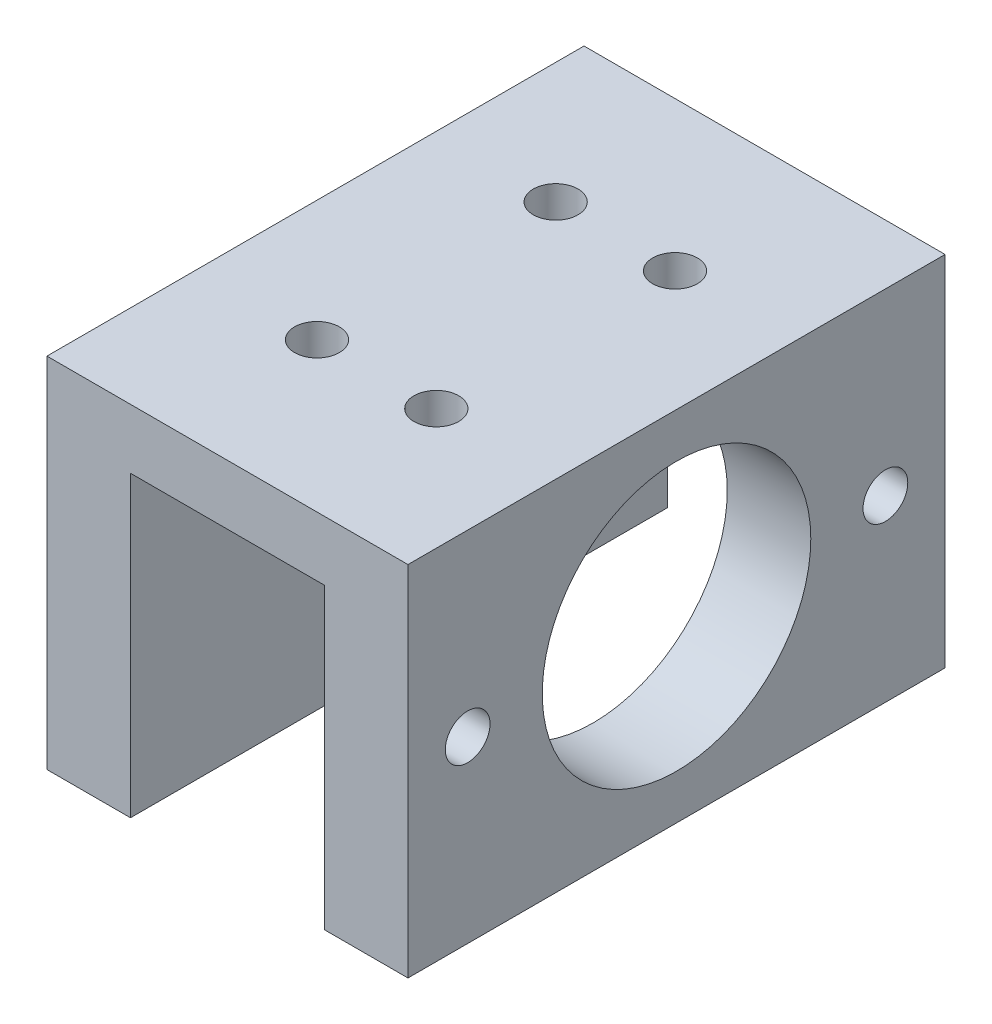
ISO-10303-21;
HEADER;
FILE_DESCRIPTION(('STEP AP214'),'2;1');
FILE_NAME('part.step','',(''),(''),'','','');
FILE_SCHEMA(('AUTOMOTIVE_DESIGN { 1 0 10303 214 1 1 1 1 }'));
ENDSEC;
DATA;
#1=APPLICATION_CONTEXT('core data for automotive mechanical design processes');
#2=APPLICATION_PROTOCOL_DEFINITION('international standard','automotive_design',2000,#1);
#3=PRODUCT_CONTEXT('',#1,'mechanical');
#4=PRODUCT('Part','Part','',(#3));
#5=PRODUCT_RELATED_PRODUCT_CATEGORY('part','',(#4));
#6=PRODUCT_DEFINITION_FORMATION('','',#4);
#7=PRODUCT_DEFINITION_CONTEXT('part definition',#1,'design');
#8=PRODUCT_DEFINITION('design','',#6,#7);
#9=PRODUCT_DEFINITION_SHAPE('','',#8);
#10=(LENGTH_UNIT() NAMED_UNIT(*) SI_UNIT(.MILLI.,.METRE.));
#11=(NAMED_UNIT(*) PLANE_ANGLE_UNIT() SI_UNIT($,.RADIAN.));
#12=(NAMED_UNIT(*) SI_UNIT($,.STERADIAN.) SOLID_ANGLE_UNIT());
#13=UNCERTAINTY_MEASURE_WITH_UNIT(LENGTH_MEASURE(1.E-05),#10,'distance_accuracy_value','');
#14=(GEOMETRIC_REPRESENTATION_CONTEXT(3) GLOBAL_UNCERTAINTY_ASSIGNED_CONTEXT((#13)) GLOBAL_UNIT_ASSIGNED_CONTEXT((#10,
#11,#12)) REPRESENTATION_CONTEXT('',''));
#15=CARTESIAN_POINT('',(0.,0.,0.));
#16=DIRECTION('',(0.,0.,1.));
#17=DIRECTION('',(1.,0.,0.));
#18=AXIS2_PLACEMENT_3D('',#15,#16,#17);
#19=CARTESIAN_POINT('',(0.,-24.,0.));
#20=DIRECTION('',(0.,1.,0.));
#21=DIRECTION('',(0.,0.,1.));
#22=AXIS2_PLACEMENT_3D('',#19,#20,#21);
#23=PLANE('',#22);
#24=DIRECTION('',(1.,0.,0.));
#25=VECTOR('',#24,1.);
#26=CARTESIAN_POINT('',(-12.1,-24.,18.));
#27=LINE('',#26,#25);
#28=CARTESIAN_POINT('',(6.5,-24.,18.));
#29=VERTEX_POINT('',#28);
#30=CARTESIAN_POINT('',(12.1,-24.,18.));
#31=VERTEX_POINT('',#30);
#32=EDGE_CURVE('E179',#29,#31,#27,.T.);
#33=ORIENTED_EDGE('',*,*,#32,.F.);
#34=DIRECTION('',(0.,0.,-1.));
#35=VECTOR('',#34,1.);
#36=CARTESIAN_POINT('',(6.5,-24.,18.));
#37=LINE('',#36,#35);
#38=CARTESIAN_POINT('',(6.5,-24.,-18.));
#39=VERTEX_POINT('',#38);
#40=EDGE_CURVE('E152',#29,#39,#37,.T.);
#41=ORIENTED_EDGE('',*,*,#40,.T.);
#42=DIRECTION('',(-1.,0.,0.));
#43=VECTOR('',#42,1.);
#44=CARTESIAN_POINT('',(12.1,-24.,-18.));
#45=LINE('',#44,#43);
#46=CARTESIAN_POINT('',(12.1,-24.,-18.));
#47=VERTEX_POINT('',#46);
#48=EDGE_CURVE('E173',#47,#39,#45,.T.);
#49=ORIENTED_EDGE('',*,*,#48,.F.);
#50=DIRECTION('',(0.,0.,-1.));
#51=VECTOR('',#50,1.);
#52=CARTESIAN_POINT('',(12.1,-24.,18.));
#53=LINE('',#52,#51);
#54=EDGE_CURVE('E168',#31,#47,#53,.T.);
#55=ORIENTED_EDGE('',*,*,#54,.F.);
#56=EDGE_LOOP('',(#33,#41,#49,#55));
#57=FACE_BOUND('',#56,.T.);
#58=ADVANCED_FACE('F16',(#57),#23,.F.);
#59=CARTESIAN_POINT('',(12.1,-24.,18.));
#60=DIRECTION('',(1.,0.,0.));
#61=DIRECTION('',(0.,0.,-1.));
#62=AXIS2_PLACEMENT_3D('',#59,#60,#61);
#63=PLANE('',#62);
#64=CARTESIAN_POINT('',(12.1,-12.,0.));
#65=DIRECTION('',(1.,0.,0.));
#66=DIRECTION('',(0.,0.,-1.));
#67=AXIS2_PLACEMENT_3D('',#64,#65,#66);
#68=CIRCLE('',#67,9.);
#69=CARTESIAN_POINT('',(12.1,-12.,-9.));
#70=VERTEX_POINT('',#69);
#71=EDGE_CURVE('E99',#70,#70,#68,.T.);
#72=ORIENTED_EDGE('',*,*,#71,.F.);
#73=EDGE_LOOP('',(#72));
#74=FACE_BOUND('',#73,.T.);
#75=CARTESIAN_POINT('',(12.1,-12.,14.));
#76=DIRECTION('',(1.,0.,0.));
#77=DIRECTION('',(0.,0.,-1.));
#78=AXIS2_PLACEMENT_3D('',#75,#76,#77);
#79=CIRCLE('',#78,1.49999999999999);
#80=CARTESIAN_POINT('',(12.1,-12.,12.5));
#81=VERTEX_POINT('',#80);
#82=EDGE_CURVE('E131',#81,#81,#79,.T.);
#83=ORIENTED_EDGE('',*,*,#82,.F.);
#84=EDGE_LOOP('',(#83));
#85=FACE_BOUND('',#84,.T.);
#86=CARTESIAN_POINT('',(12.1,-12.,-14.));
#87=DIRECTION('',(1.,0.,0.));
#88=DIRECTION('',(0.,0.,-1.));
#89=AXIS2_PLACEMENT_3D('',#86,#87,#88);
#90=CIRCLE('',#89,1.49999999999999);
#91=CARTESIAN_POINT('',(12.1,-12.,-15.5));
#92=VERTEX_POINT('',#91);
#93=EDGE_CURVE('E137',#92,#92,#90,.T.);
#94=ORIENTED_EDGE('',*,*,#93,.F.);
#95=EDGE_LOOP('',(#94));
#96=FACE_BOUND('',#95,.T.);
#97=DIRECTION('',(0.,0.,-1.));
#98=VECTOR('',#97,1.);
#99=CARTESIAN_POINT('',(12.1,0.,18.));
#100=LINE('',#99,#98);
#101=CARTESIAN_POINT('',(12.1,0.,18.));
#102=VERTEX_POINT('',#101);
#103=CARTESIAN_POINT('',(12.1,0.,-18.));
#104=VERTEX_POINT('',#103);
#105=EDGE_CURVE('E161',#102,#104,#100,.T.);
#106=ORIENTED_EDGE('',*,*,#105,.F.);
#107=DIRECTION('',(0.,1.,0.));
#108=VECTOR('',#107,1.);
#109=CARTESIAN_POINT('',(12.1,-24.,18.));
#110=LINE('',#109,#108);
#111=EDGE_CURVE('E24',#31,#102,#110,.T.);
#112=ORIENTED_EDGE('',*,*,#111,.F.);
#113=ORIENTED_EDGE('',*,*,#54,.T.);
#114=DIRECTION('',(0.,1.,0.));
#115=VECTOR('',#114,1.);
#116=CARTESIAN_POINT('',(12.1,-24.,-18.));
#117=LINE('',#116,#115);
#118=EDGE_CURVE('E183',#47,#104,#117,.T.);
#119=ORIENTED_EDGE('',*,*,#118,.T.);
#120=EDGE_LOOP('',(#106,#112,#113,#119));
#121=FACE_BOUND('',#120,.T.);
#122=ADVANCED_FACE('F18',(#74,#85,#96,#121),#63,.T.);
#123=CARTESIAN_POINT('',(-12.1,-24.,18.));
#124=DIRECTION('',(0.,0.,1.));
#125=DIRECTION('',(1.,0.,0.));
#126=AXIS2_PLACEMENT_3D('',#123,#124,#125);
#127=PLANE('',#126);
#128=DIRECTION('',(0.,-1.,0.));
#129=VECTOR('',#128,1.);
#130=CARTESIAN_POINT('',(6.5,-4.,18.));
#131=LINE('',#130,#129);
#132=CARTESIAN_POINT('',(6.5,-4.,18.));
#133=VERTEX_POINT('',#132);
#134=EDGE_CURVE('E144',#133,#29,#131,.T.);
#135=ORIENTED_EDGE('',*,*,#134,.T.);
#136=ORIENTED_EDGE('',*,*,#32,.T.);
#137=ORIENTED_EDGE('',*,*,#111,.T.);
#138=DIRECTION('',(1.,0.,0.));
#139=VECTOR('',#138,1.);
#140=CARTESIAN_POINT('',(-12.1,0.,18.));
#141=LINE('',#140,#139);
#142=CARTESIAN_POINT('',(-12.1,0.,18.));
#143=VERTEX_POINT('',#142);
#144=EDGE_CURVE('E172',#143,#102,#141,.T.);
#145=ORIENTED_EDGE('',*,*,#144,.F.);
#146=DIRECTION('',(0.,1.,0.));
#147=VECTOR('',#146,1.);
#148=CARTESIAN_POINT('',(-12.1,-24.,18.));
#149=LINE('',#148,#147);
#150=CARTESIAN_POINT('',(-12.1,-24.,18.));
#151=VERTEX_POINT('',#150);
#152=EDGE_CURVE('E195',#151,#143,#149,.T.);
#153=ORIENTED_EDGE('',*,*,#152,.F.);
#154=CARTESIAN_POINT('',(-6.5,-24.,18.));
#155=VERTEX_POINT('',#154);
#156=EDGE_CURVE('E180',#151,#155,#27,.T.);
#157=ORIENTED_EDGE('',*,*,#156,.T.);
#158=DIRECTION('',(0.,1.,0.));
#159=VECTOR('',#158,1.);
#160=CARTESIAN_POINT('',(-6.5,-24.,18.));
#161=LINE('',#160,#159);
#162=CARTESIAN_POINT('',(-6.5,-4.,18.));
#163=VERTEX_POINT('',#162);
#164=EDGE_CURVE('E38',#155,#163,#161,.T.);
#165=ORIENTED_EDGE('',*,*,#164,.T.);
#166=DIRECTION('',(1.,0.,0.));
#167=VECTOR('',#166,1.);
#168=CARTESIAN_POINT('',(-6.5,-4.,18.));
#169=LINE('',#168,#167);
#170=EDGE_CURVE('E149',#163,#133,#169,.T.);
#171=ORIENTED_EDGE('',*,*,#170,.T.);
#172=EDGE_LOOP('',(#135,#136,#137,#145,#153,#157,#165,#171));
#173=FACE_BOUND('',#172,.T.);
#174=ADVANCED_FACE('F231',(#173),#127,.T.);
#175=CARTESIAN_POINT('',(-12.1,-24.,-18.));
#176=DIRECTION('',(-1.,0.,0.));
#177=DIRECTION('',(0.,0.,1.));
#178=AXIS2_PLACEMENT_3D('',#175,#176,#177);
#179=PLANE('',#178);
#180=DIRECTION('',(0.,0.,1.));
#181=VECTOR('',#180,1.);
#182=CARTESIAN_POINT('',(-12.1,0.,-18.));
#183=LINE('',#182,#181);
#184=CARTESIAN_POINT('',(-12.1,0.,-18.));
#185=VERTEX_POINT('',#184);
#186=EDGE_CURVE('E189',#185,#143,#183,.T.);
#187=ORIENTED_EDGE('',*,*,#186,.F.);
#188=DIRECTION('',(0.,1.,0.));
#189=VECTOR('',#188,1.);
#190=CARTESIAN_POINT('',(-12.1,-24.,-18.));
#191=LINE('',#190,#189);
#192=CARTESIAN_POINT('',(-12.1,-24.,-18.));
#193=VERTEX_POINT('',#192);
#194=EDGE_CURVE('E197',#193,#185,#191,.T.);
#195=ORIENTED_EDGE('',*,*,#194,.F.);
#196=DIRECTION('',(0.,0.,1.));
#197=VECTOR('',#196,1.);
#198=CARTESIAN_POINT('',(-12.1,-24.,-18.));
#199=LINE('',#198,#197);
#200=EDGE_CURVE('E176',#193,#151,#199,.T.);
#201=ORIENTED_EDGE('',*,*,#200,.T.);
#202=ORIENTED_EDGE('',*,*,#152,.T.);
#203=EDGE_LOOP('',(#187,#195,#201,#202));
#204=FACE_BOUND('',#203,.T.);
#205=ADVANCED_FACE('F247',(#204),#179,.T.);
#206=CARTESIAN_POINT('',(12.1,-24.,-18.));
#207=DIRECTION('',(0.,0.,-1.));
#208=DIRECTION('',(-1.,0.,0.));
#209=AXIS2_PLACEMENT_3D('',#206,#207,#208);
#210=PLANE('',#209);
#211=DIRECTION('',(0.,-1.,0.));
#212=VECTOR('',#211,1.);
#213=CARTESIAN_POINT('',(6.5,-4.,-18.));
#214=LINE('',#213,#212);
#215=CARTESIAN_POINT('',(6.5,-4.,-18.));
#216=VERTEX_POINT('',#215);
#217=EDGE_CURVE('E143',#216,#39,#214,.T.);
#218=ORIENTED_EDGE('',*,*,#217,.F.);
#219=DIRECTION('',(1.,0.,0.));
#220=VECTOR('',#219,1.);
#221=CARTESIAN_POINT('',(-6.5,-4.,-18.));
#222=LINE('',#221,#220);
#223=CARTESIAN_POINT('',(-6.5,-4.,-18.));
#224=VERTEX_POINT('',#223);
#225=EDGE_CURVE('E147',#224,#216,#222,.T.);
#226=ORIENTED_EDGE('',*,*,#225,.F.);
#227=DIRECTION('',(0.,1.,0.));
#228=VECTOR('',#227,1.);
#229=CARTESIAN_POINT('',(-6.5,-24.,-18.));
#230=LINE('',#229,#228);
#231=CARTESIAN_POINT('',(-6.5,-24.,-18.));
#232=VERTEX_POINT('',#231);
#233=EDGE_CURVE('E154',#232,#224,#230,.T.);
#234=ORIENTED_EDGE('',*,*,#233,.F.);
#235=EDGE_CURVE('E171',#232,#193,#45,.T.);
#236=ORIENTED_EDGE('',*,*,#235,.T.);
#237=ORIENTED_EDGE('',*,*,#194,.T.);
#238=DIRECTION('',(-1.,0.,0.));
#239=VECTOR('',#238,1.);
#240=CARTESIAN_POINT('',(12.1,0.,-18.));
#241=LINE('',#240,#239);
#242=EDGE_CURVE('E186',#104,#185,#241,.T.);
#243=ORIENTED_EDGE('',*,*,#242,.F.);
#244=ORIENTED_EDGE('',*,*,#118,.F.);
#245=ORIENTED_EDGE('',*,*,#48,.T.);
#246=EDGE_LOOP('',(#218,#226,#234,#236,#237,#243,#244,#245));
#247=FACE_BOUND('',#246,.T.);
#248=ADVANCED_FACE('F238',(#247),#210,.T.);
#249=ORIENTED_EDGE('',*,*,#235,.F.);
#250=DIRECTION('',(0.,0.,-1.));
#251=VECTOR('',#250,1.);
#252=CARTESIAN_POINT('',(-6.5,-24.,18.));
#253=LINE('',#252,#251);
#254=EDGE_CURVE('E164',#155,#232,#253,.T.);
#255=ORIENTED_EDGE('',*,*,#254,.F.);
#256=ORIENTED_EDGE('',*,*,#156,.F.);
#257=ORIENTED_EDGE('',*,*,#200,.F.);
#258=EDGE_LOOP('',(#249,#255,#256,#257));
#259=FACE_BOUND('',#258,.T.);
#260=ADVANCED_FACE('F226',(#259),#23,.F.);
#261=CARTESIAN_POINT('',(0.,0.,0.));
#262=DIRECTION('',(0.,1.,0.));
#263=DIRECTION('',(0.,0.,1.));
#264=AXIS2_PLACEMENT_3D('',#261,#262,#263);
#265=PLANE('',#264);
#266=CARTESIAN_POINT('',(4.,0.,8.));
#267=DIRECTION('',(0.,1.,0.));
#268=DIRECTION('',(0.,0.,1.));
#269=AXIS2_PLACEMENT_3D('',#266,#267,#268);
#270=CIRCLE('',#269,1.49999999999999);
#271=CARTESIAN_POINT('',(4.,0.,9.49999999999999));
#272=VERTEX_POINT('',#271);
#273=EDGE_CURVE('E111',#272,#272,#270,.T.);
#274=ORIENTED_EDGE('',*,*,#273,.F.);
#275=EDGE_LOOP('',(#274));
#276=FACE_BOUND('',#275,.T.);
#277=CARTESIAN_POINT('',(-4.,0.,8.));
#278=DIRECTION('',(0.,1.,0.));
#279=DIRECTION('',(0.,0.,1.));
#280=AXIS2_PLACEMENT_3D('',#277,#278,#279);
#281=CIRCLE('',#280,1.49999999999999);
#282=CARTESIAN_POINT('',(-4.,0.,9.49999999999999));
#283=VERTEX_POINT('',#282);
#284=EDGE_CURVE('E117',#283,#283,#281,.T.);
#285=ORIENTED_EDGE('',*,*,#284,.F.);
#286=EDGE_LOOP('',(#285));
#287=FACE_BOUND('',#286,.T.);
#288=CARTESIAN_POINT('',(-4.,0.,-8.));
#289=DIRECTION('',(0.,1.,0.));
#290=DIRECTION('',(0.,0.,1.));
#291=AXIS2_PLACEMENT_3D('',#288,#289,#290);
#292=CIRCLE('',#291,1.49999999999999);
#293=CARTESIAN_POINT('',(-4.,0.,-6.50000000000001));
#294=VERTEX_POINT('',#293);
#295=EDGE_CURVE('E121',#294,#294,#292,.T.);
#296=ORIENTED_EDGE('',*,*,#295,.F.);
#297=EDGE_LOOP('',(#296));
#298=FACE_BOUND('',#297,.T.);
#299=CARTESIAN_POINT('',(4.,0.,-8.));
#300=DIRECTION('',(0.,1.,0.));
#301=DIRECTION('',(0.,0.,1.));
#302=AXIS2_PLACEMENT_3D('',#299,#300,#301);
#303=CIRCLE('',#302,1.49999999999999);
#304=CARTESIAN_POINT('',(4.,0.,-6.50000000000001));
#305=VERTEX_POINT('',#304);
#306=EDGE_CURVE('E125',#305,#305,#303,.T.);
#307=ORIENTED_EDGE('',*,*,#306,.F.);
#308=EDGE_LOOP('',(#307));
#309=FACE_BOUND('',#308,.T.);
#310=ORIENTED_EDGE('',*,*,#105,.T.);
#311=ORIENTED_EDGE('',*,*,#242,.T.);
#312=ORIENTED_EDGE('',*,*,#186,.T.);
#313=ORIENTED_EDGE('',*,*,#144,.T.);
#314=EDGE_LOOP('',(#310,#311,#312,#313));
#315=FACE_BOUND('',#314,.T.);
#316=ADVANCED_FACE('F237',(#276,#287,#298,#309,#315),#265,.T.);
#317=CARTESIAN_POINT('',(6.5,-4.,18.));
#318=DIRECTION('',(1.,0.,0.));
#319=DIRECTION('',(0.,0.,-1.));
#320=AXIS2_PLACEMENT_3D('',#317,#318,#319);
#321=PLANE('',#320);
#322=CARTESIAN_POINT('',(6.5,-12.,14.));
#323=DIRECTION('',(1.,0.,0.));
#324=DIRECTION('',(0.,0.,-1.));
#325=AXIS2_PLACEMENT_3D('',#322,#323,#324);
#326=CIRCLE('',#325,1.5);
#327=CARTESIAN_POINT('',(6.5,-12.,12.5));
#328=VERTEX_POINT('',#327);
#329=EDGE_CURVE('E134',#328,#328,#326,.T.);
#330=ORIENTED_EDGE('',*,*,#329,.T.);
#331=EDGE_LOOP('',(#330));
#332=FACE_BOUND('',#331,.T.);
#333=CARTESIAN_POINT('',(6.5,-12.,-14.));
#334=DIRECTION('',(1.,0.,0.));
#335=DIRECTION('',(0.,0.,-1.));
#336=AXIS2_PLACEMENT_3D('',#333,#334,#335);
#337=CIRCLE('',#336,1.5);
#338=CARTESIAN_POINT('',(6.5,-12.,-15.5));
#339=VERTEX_POINT('',#338);
#340=EDGE_CURVE('E140',#339,#339,#337,.T.);
#341=ORIENTED_EDGE('',*,*,#340,.T.);
#342=EDGE_LOOP('',(#341));
#343=FACE_BOUND('',#342,.T.);
#344=DIRECTION('',(0.,0.,-1.));
#345=VECTOR('',#344,1.);
#346=CARTESIAN_POINT('',(6.5,-4.,18.));
#347=LINE('',#346,#345);
#348=CARTESIAN_POINT('',(6.5,-4.,4.12310562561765));
#349=VERTEX_POINT('',#348);
#350=EDGE_CURVE('E158',#133,#349,#347,.T.);
#351=ORIENTED_EDGE('',*,*,#350,.T.);
#352=CARTESIAN_POINT('',(6.5,-12.,0.));
#353=DIRECTION('',(1.,0.,0.));
#354=DIRECTION('',(0.,0.,-1.));
#355=AXIS2_PLACEMENT_3D('',#352,#353,#354);
#356=CIRCLE('',#355,9.);
#357=CARTESIAN_POINT('',(6.5,-4.,-4.12310562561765));
#358=VERTEX_POINT('',#357);
#359=EDGE_CURVE('E105',#349,#358,#356,.T.);
#360=ORIENTED_EDGE('',*,*,#359,.T.);
#361=EDGE_CURVE('E104',#358,#216,#347,.T.);
#362=ORIENTED_EDGE('',*,*,#361,.T.);
#363=ORIENTED_EDGE('',*,*,#217,.T.);
#364=ORIENTED_EDGE('',*,*,#40,.F.);
#365=ORIENTED_EDGE('',*,*,#134,.F.);
#366=EDGE_LOOP('',(#351,#360,#362,#363,#364,#365));
#367=FACE_BOUND('',#366,.T.);
#368=ADVANCED_FACE('F245',(#332,#343,#367),#321,.F.);
#369=CARTESIAN_POINT('',(-6.5,-4.,18.));
#370=DIRECTION('',(0.,1.,0.));
#371=DIRECTION('',(0.,0.,1.));
#372=AXIS2_PLACEMENT_3D('',#369,#370,#371);
#373=PLANE('',#372);
#374=CARTESIAN_POINT('',(4.,-4.,8.));
#375=DIRECTION('',(0.,1.,0.));
#376=DIRECTION('',(0.,0.,1.));
#377=AXIS2_PLACEMENT_3D('',#374,#375,#376);
#378=CIRCLE('',#377,1.49999999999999);
#379=CARTESIAN_POINT('',(4.,-4.,9.49999999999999));
#380=VERTEX_POINT('',#379);
#381=EDGE_CURVE('E114',#380,#380,#378,.T.);
#382=ORIENTED_EDGE('',*,*,#381,.T.);
#383=EDGE_LOOP('',(#382));
#384=FACE_BOUND('',#383,.T.);
#385=CARTESIAN_POINT('',(-4.,-4.,8.));
#386=DIRECTION('',(0.,1.,0.));
#387=DIRECTION('',(0.,0.,1.));
#388=AXIS2_PLACEMENT_3D('',#385,#386,#387);
#389=CIRCLE('',#388,1.49999999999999);
#390=CARTESIAN_POINT('',(-4.,-4.,9.49999999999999));
#391=VERTEX_POINT('',#390);
#392=EDGE_CURVE('E120',#391,#391,#389,.T.);
#393=ORIENTED_EDGE('',*,*,#392,.T.);
#394=EDGE_LOOP('',(#393));
#395=FACE_BOUND('',#394,.T.);
#396=CARTESIAN_POINT('',(-4.,-4.,-8.));
#397=DIRECTION('',(0.,1.,0.));
#398=DIRECTION('',(0.,0.,1.));
#399=AXIS2_PLACEMENT_3D('',#396,#397,#398);
#400=CIRCLE('',#399,1.49999999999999);
#401=CARTESIAN_POINT('',(-4.,-4.,-6.50000000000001));
#402=VERTEX_POINT('',#401);
#403=EDGE_CURVE('E124',#402,#402,#400,.T.);
#404=ORIENTED_EDGE('',*,*,#403,.T.);
#405=EDGE_LOOP('',(#404));
#406=FACE_BOUND('',#405,.T.);
#407=CARTESIAN_POINT('',(4.,-4.,-8.));
#408=DIRECTION('',(0.,1.,0.));
#409=DIRECTION('',(0.,0.,1.));
#410=AXIS2_PLACEMENT_3D('',#407,#408,#409);
#411=CIRCLE('',#410,1.49999999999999);
#412=CARTESIAN_POINT('',(4.,-4.,-6.50000000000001));
#413=VERTEX_POINT('',#412);
#414=EDGE_CURVE('E128',#413,#413,#411,.T.);
#415=ORIENTED_EDGE('',*,*,#414,.T.);
#416=EDGE_LOOP('',(#415));
#417=FACE_BOUND('',#416,.T.);
#418=DIRECTION('',(0.,0.,1.));
#419=VECTOR('',#418,1.);
#420=CARTESIAN_POINT('',(3.1,-4.,18.));
#421=LINE('',#420,#419);
#422=CARTESIAN_POINT('',(3.1,-4.,-4.12310562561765));
#423=VERTEX_POINT('',#422);
#424=CARTESIAN_POINT('',(3.1,-4.,4.12310562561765));
#425=VERTEX_POINT('',#424);
#426=EDGE_CURVE('E10',#423,#425,#421,.T.);
#427=ORIENTED_EDGE('',*,*,#426,.T.);
#428=DIRECTION('',(1.,0.,0.));
#429=VECTOR('',#428,1.);
#430=CARTESIAN_POINT('',(12.1,-4.,4.12310562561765));
#431=LINE('',#430,#429);
#432=EDGE_CURVE('E98',#425,#349,#431,.T.);
#433=ORIENTED_EDGE('',*,*,#432,.T.);
#434=ORIENTED_EDGE('',*,*,#350,.F.);
#435=ORIENTED_EDGE('',*,*,#170,.F.);
#436=DIRECTION('',(0.,0.,-1.));
#437=VECTOR('',#436,1.);
#438=CARTESIAN_POINT('',(-6.5,-4.,18.));
#439=LINE('',#438,#437);
#440=EDGE_CURVE('E162',#163,#224,#439,.T.);
#441=ORIENTED_EDGE('',*,*,#440,.T.);
#442=ORIENTED_EDGE('',*,*,#225,.T.);
#443=ORIENTED_EDGE('',*,*,#361,.F.);
#444=DIRECTION('',(1.,0.,0.));
#445=VECTOR('',#444,1.);
#446=CARTESIAN_POINT('',(12.1,-4.,-4.12310562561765));
#447=LINE('',#446,#445);
#448=EDGE_CURVE('E96',#358,#423,#447,.F.);
#449=ORIENTED_EDGE('',*,*,#448,.T.);
#450=EDGE_LOOP('',(#427,#433,#434,#435,#441,#442,#443,#449));
#451=FACE_BOUND('',#450,.T.);
#452=ADVANCED_FACE('F102',(#384,#395,#406,#417,#451),#373,.F.);
#453=CARTESIAN_POINT('',(-6.5,-24.,18.));
#454=DIRECTION('',(-1.,0.,0.));
#455=DIRECTION('',(0.,0.,1.));
#456=AXIS2_PLACEMENT_3D('',#453,#454,#455);
#457=PLANE('',#456);
#458=ORIENTED_EDGE('',*,*,#233,.T.);
#459=ORIENTED_EDGE('',*,*,#440,.F.);
#460=ORIENTED_EDGE('',*,*,#164,.F.);
#461=ORIENTED_EDGE('',*,*,#254,.T.);
#462=EDGE_LOOP('',(#458,#459,#460,#461));
#463=FACE_BOUND('',#462,.T.);
#464=ADVANCED_FACE('F270',(#463),#457,.F.);
#465=CARTESIAN_POINT('',(12.1,-12.,-14.));
#466=DIRECTION('',(1.,0.,0.));
#467=DIRECTION('',(0.,0.,-1.));
#468=AXIS2_PLACEMENT_3D('',#465,#466,#467);
#469=CYLINDRICAL_SURFACE('',#468,1.5);
#470=ORIENTED_EDGE('',*,*,#340,.F.);
#471=EDGE_LOOP('',(#470));
#472=FACE_BOUND('',#471,.T.);
#473=ORIENTED_EDGE('',*,*,#93,.T.);
#474=EDGE_LOOP('',(#473));
#475=FACE_BOUND('',#474,.T.);
#476=ADVANCED_FACE('F272',(#472,#475),#469,.F.);
#477=CARTESIAN_POINT('',(12.1,-12.,14.));
#478=DIRECTION('',(1.,0.,0.));
#479=DIRECTION('',(0.,0.,-1.));
#480=AXIS2_PLACEMENT_3D('',#477,#478,#479);
#481=CYLINDRICAL_SURFACE('',#480,1.5);
#482=ORIENTED_EDGE('',*,*,#329,.F.);
#483=EDGE_LOOP('',(#482));
#484=FACE_BOUND('',#483,.T.);
#485=ORIENTED_EDGE('',*,*,#82,.T.);
#486=EDGE_LOOP('',(#485));
#487=FACE_BOUND('',#486,.T.);
#488=ADVANCED_FACE('F279',(#484,#487),#481,.F.);
#489=CARTESIAN_POINT('',(4.,0.,-8.));
#490=DIRECTION('',(0.,1.,0.));
#491=DIRECTION('',(0.,0.,1.));
#492=AXIS2_PLACEMENT_3D('',#489,#490,#491);
#493=CYLINDRICAL_SURFACE('',#492,1.49999999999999);
#494=ORIENTED_EDGE('',*,*,#306,.T.);
#495=EDGE_LOOP('',(#494));
#496=FACE_BOUND('',#495,.T.);
#497=ORIENTED_EDGE('',*,*,#414,.F.);
#498=EDGE_LOOP('',(#497));
#499=FACE_BOUND('',#498,.T.);
#500=ADVANCED_FACE('F220',(#496,#499),#493,.F.);
#501=CARTESIAN_POINT('',(-4.,0.,-8.));
#502=DIRECTION('',(0.,1.,0.));
#503=DIRECTION('',(0.,0.,1.));
#504=AXIS2_PLACEMENT_3D('',#501,#502,#503);
#505=CYLINDRICAL_SURFACE('',#504,1.49999999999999);
#506=ORIENTED_EDGE('',*,*,#295,.T.);
#507=EDGE_LOOP('',(#506));
#508=FACE_BOUND('',#507,.T.);
#509=ORIENTED_EDGE('',*,*,#403,.F.);
#510=EDGE_LOOP('',(#509));
#511=FACE_BOUND('',#510,.T.);
#512=ADVANCED_FACE('F209',(#508,#511),#505,.F.);
#513=CARTESIAN_POINT('',(-4.,0.,8.));
#514=DIRECTION('',(0.,1.,0.));
#515=DIRECTION('',(0.,0.,1.));
#516=AXIS2_PLACEMENT_3D('',#513,#514,#515);
#517=CYLINDRICAL_SURFACE('',#516,1.49999999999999);
#518=ORIENTED_EDGE('',*,*,#284,.T.);
#519=EDGE_LOOP('',(#518));
#520=FACE_BOUND('',#519,.T.);
#521=ORIENTED_EDGE('',*,*,#392,.F.);
#522=EDGE_LOOP('',(#521));
#523=FACE_BOUND('',#522,.T.);
#524=ADVANCED_FACE('F206',(#520,#523),#517,.F.);
#525=CARTESIAN_POINT('',(4.,0.,8.));
#526=DIRECTION('',(0.,1.,0.));
#527=DIRECTION('',(0.,0.,1.));
#528=AXIS2_PLACEMENT_3D('',#525,#526,#527);
#529=CYLINDRICAL_SURFACE('',#528,1.49999999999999);
#530=ORIENTED_EDGE('',*,*,#273,.T.);
#531=EDGE_LOOP('',(#530));
#532=FACE_BOUND('',#531,.T.);
#533=ORIENTED_EDGE('',*,*,#381,.F.);
#534=EDGE_LOOP('',(#533));
#535=FACE_BOUND('',#534,.T.);
#536=ADVANCED_FACE('F208',(#532,#535),#529,.F.);
#537=CARTESIAN_POINT('',(3.1,-12.,0.));
#538=DIRECTION('',(-1.,0.,0.));
#539=DIRECTION('',(0.,0.,1.));
#540=AXIS2_PLACEMENT_3D('',#537,#538,#539);
#541=PLANE('',#540);
#542=CARTESIAN_POINT('',(3.1,-12.,0.));
#543=DIRECTION('',(1.,0.,0.));
#544=DIRECTION('',(0.,0.,-1.));
#545=AXIS2_PLACEMENT_3D('',#542,#543,#544);
#546=CIRCLE('',#545,9.);
#547=EDGE_CURVE('E30',#423,#425,#546,.T.);
#548=ORIENTED_EDGE('',*,*,#547,.T.);
#549=ORIENTED_EDGE('',*,*,#426,.F.);
#550=EDGE_LOOP('',(#548,#549));
#551=FACE_BOUND('',#550,.T.);
#552=ADVANCED_FACE('F90',(#551),#541,.F.);
#553=CARTESIAN_POINT('',(12.1,-12.,0.));
#554=DIRECTION('',(1.,0.,0.));
#555=DIRECTION('',(0.,0.,-1.));
#556=AXIS2_PLACEMENT_3D('',#553,#554,#555);
#557=CYLINDRICAL_SURFACE('',#556,9.);
#558=ORIENTED_EDGE('',*,*,#71,.T.);
#559=EDGE_LOOP('',(#558));
#560=FACE_BOUND('',#559,.T.);
#561=ORIENTED_EDGE('',*,*,#547,.F.);
#562=ORIENTED_EDGE('',*,*,#448,.F.);
#563=ORIENTED_EDGE('',*,*,#359,.F.);
#564=ORIENTED_EDGE('',*,*,#432,.F.);
#565=EDGE_LOOP('',(#561,#562,#563,#564));
#566=FACE_BOUND('',#565,.T.);
#567=ADVANCED_FACE('F95',(#560,#566),#557,.F.);
#568=CLOSED_SHELL('',(#58,#122,#174,#205,#248,#260,#316,#368,#452,#464,#476,#488,#500,#512,#524,
#536,#552,#567));
#569=MANIFOLD_SOLID_BREP('B1',#568);
#570=ADVANCED_BREP_SHAPE_REPRESENTATION('',(#18,#569),#14);
#571=SHAPE_DEFINITION_REPRESENTATION(#9,#570);
ENDSEC;
END-ISO-10303-21;
